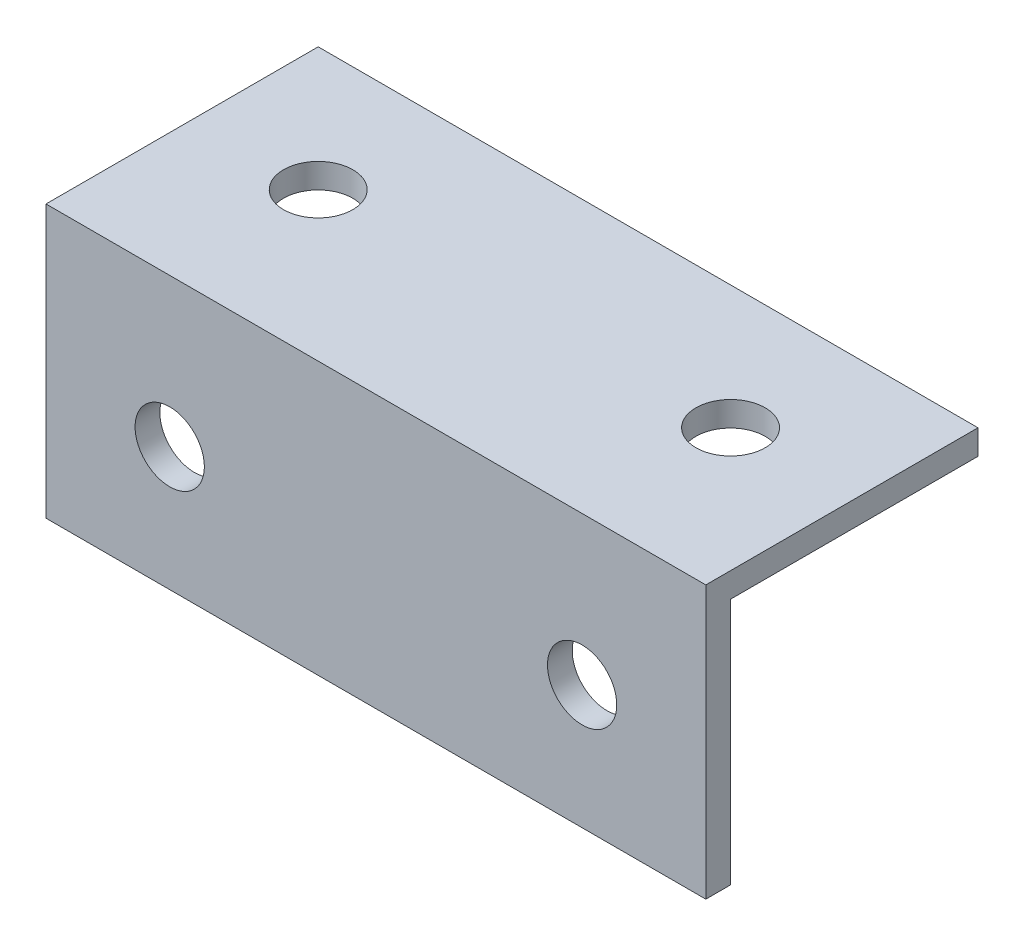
from build123d import *

# Parameters (mm, degrees)
BENT_CORNER_BRACE_DEPTH            = 50.8
TOP_FLANGE_SCREW_HOLES_DEPTH       = 58.501695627
TOP_FLANGE_SCREW_HOLES_DEPTH_BACK  = 58.501695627
SKETCH2_R                          = 2.667
SIDE_FLANGE_SCREW_HOLES_DEPTH      = 58.501695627
SIDE_FLANGE_SCREW_HOLES_DEPTH_BACK = 58.501695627
SKETCH3_R                          = 2.667


with BuildPart() as part:
    # Sketch1 → Bent_corner_brace (new body)
    with BuildSketch(Plane.YZ):
        Polygon((-19.05, 0), (0, 0), (0, -19.05), (1.905, -19.05), (1.905, 1.905), (-19.05, 1.905), align=None)
    extrude(amount=BENT_CORNER_BRACE_DEPTH)

    # Sketch2 → Top_flange_screw_holes (cut, two sides: drawn at the far end of the back side and taken through both)
    with BuildSketch(Plane(origin=(0, 0, 0), x_dir=(0, 1, 0), z_dir=(0, 0, 1)).offset(-TOP_FLANGE_SCREW_HOLES_DEPTH_BACK)):
        with Locations(Location((-9.525, -9.525, 0), (0, 0, 270))):
            Circle(SKETCH2_R)
        with Locations(Location((-9.525, -41.275, 0), (0, 0, 270))):
            Circle(SKETCH2_R)
    extrude(amount=TOP_FLANGE_SCREW_HOLES_DEPTH + TOP_FLANGE_SCREW_HOLES_DEPTH_BACK, mode=Mode.SUBTRACT)

    # Sketch3 → Side_flange_screw_holes (cut, two sides: drawn at the far end of the back side and taken through both)
    with BuildSketch(Plane(origin=(0, 0, 0), x_dir=(-1, 0, 0), z_dir=(0, 1, 0)).offset(-SIDE_FLANGE_SCREW_HOLES_DEPTH_BACK)):
        with Locations(Location((-9.525, -9.525, 0), (0, 0, 90))):
            Circle(SKETCH3_R)
        with Locations(Location((-41.275, -9.525, 0), (0, 0, 90))):
            Circle(SKETCH3_R)
    extrude(amount=SIDE_FLANGE_SCREW_HOLES_DEPTH + SIDE_FLANGE_SCREW_HOLES_DEPTH_BACK, mode=Mode.SUBTRACT)


solid = part.part
